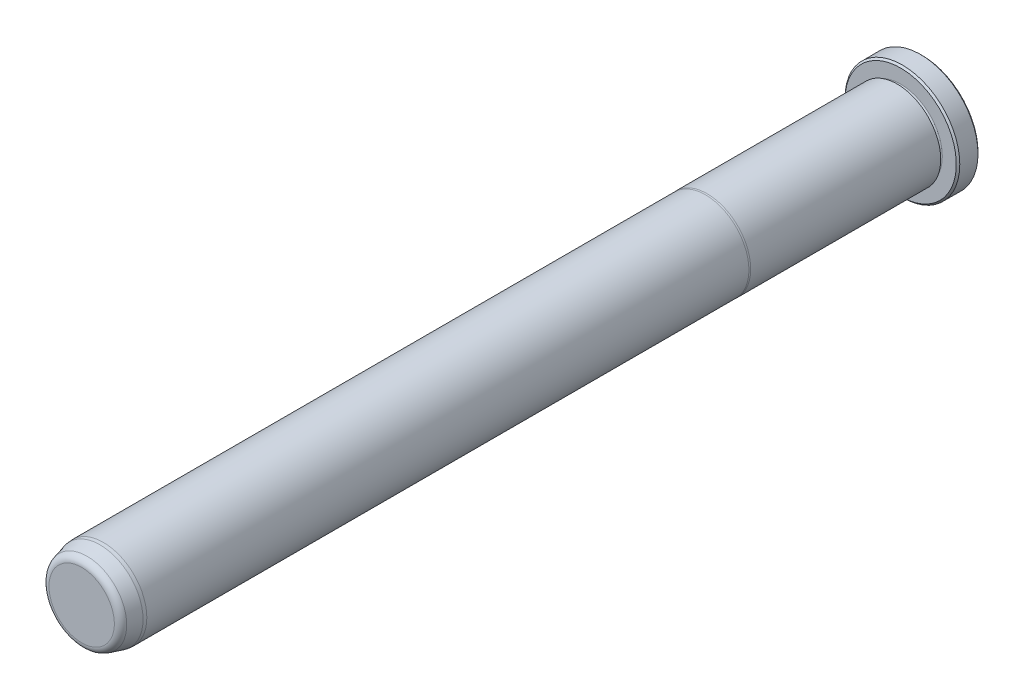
from build123d import *

# Parameters (mm, degrees)
FILLET6_R     = 1.5875
CHAMFER1_SIZE = 0.381


with BuildPart() as part:
    # Sketch1 → Revolve1 (revolve)
    with BuildSketch(Plane(origin=(0, 0, 0), x_dir=(0, 0, -1), z_dir=(1, 0, 0)), mode=Mode.PRIVATE) as revolve1_sk:
        with BuildLine():
            Line((0, 0), (0, 12.573))
            Line((0, 12.573), (-4.7498, 12.573))
            Line((-4.7498, 12.573), (-4.7498, 9.1313))
            ThreePointArc((-4.7498, 9.1313), (-5.1308, 8.7503), (-5.5118, 9.1313))
            Line((-5.5118, 9.1313), (-5.5118, 9.5377))
            Line((-5.5118, 9.5377), (-47.134763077, 9.5377))
            Line((-47.134763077, 9.5377), (-47.498, 9.5123))
            Line((-47.498, 9.5123), (-179.3875, 9.5123))
            Line((-179.3875, 9.5123), (-180.1495, 9.445633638))
            Line((-180.1495, 9.445633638), (-184.15, 8.373702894))
            Line((-184.15, 8.373702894), (-184.15, 0))
            Line((-184.15, 0), (0, 0))
        make_face()
    revolve(revolve1_sk.sketch.rotate(Axis((0, 0, 0), (0, 0, -1)), 90), axis=Axis((0, 0, 0), (0, 0, -1)))

    # Fillet6
    fillet6_edges = [part.edges().sort_by_distance(p)[0] for p in [
        (-8.373702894, 0, 184.15),
    ]]
    fillet(fillet6_edges, radius=FILLET6_R)

    # Chamfer1
    chamfer1_edges = [part.edges().sort_by_distance(p)[0] for p in [
        (-12.573, 0, 4.7498),
        (-12.573, 0, 0),
    ]]
    chamfer(chamfer1_edges, length=CHAMFER1_SIZE)


solid = part.part
